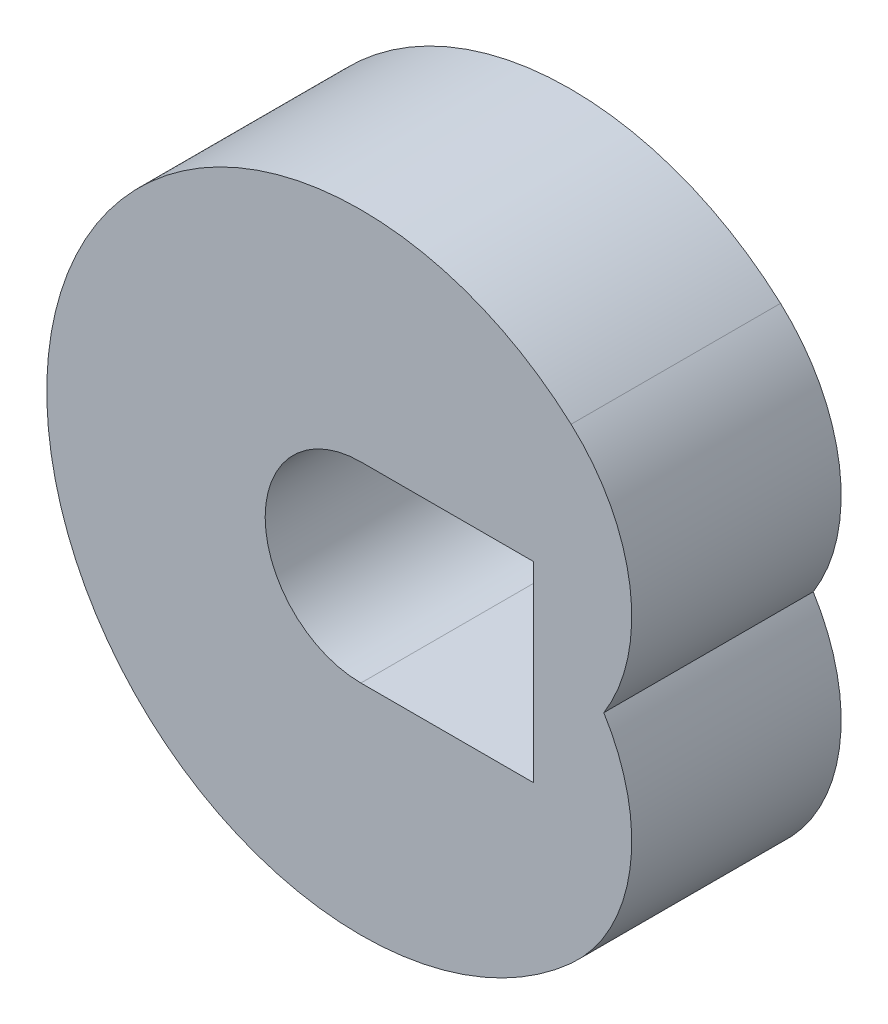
from build123d import *

# Parameters (mm, degrees)
EXTRUDE_1_DEPTH = 400


with BuildPart() as part:
    # Sketch 1 → Extrude 1 (new body)
    with BuildSketch(Plane.XY):
        with BuildLine():
            ThreePointArc((401.478363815, 445.886895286), (-600, 0), (401.478363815, -445.886895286))
            ThreePointArc((401.478363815, -445.886895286), (513.902238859, -234.313123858), (463.902754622, 0))
            ThreePointArc((463.902754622, 0), (513.902238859, 234.313123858), (401.478363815, 445.886895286))
        make_face()
        with BuildLine():
            Line((0, 182.881257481), (330, 182.881257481))
            Line((330, 182.881257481), (330, -182.881257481))
            Line((330, -182.881257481), (0, -182.881257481))
            ThreePointArc((0, -182.881257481), (-182.881257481, 0), (0, 182.881257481))
        make_face(mode=Mode.SUBTRACT)
    extrude(amount=EXTRUDE_1_DEPTH)


solid = part.part
